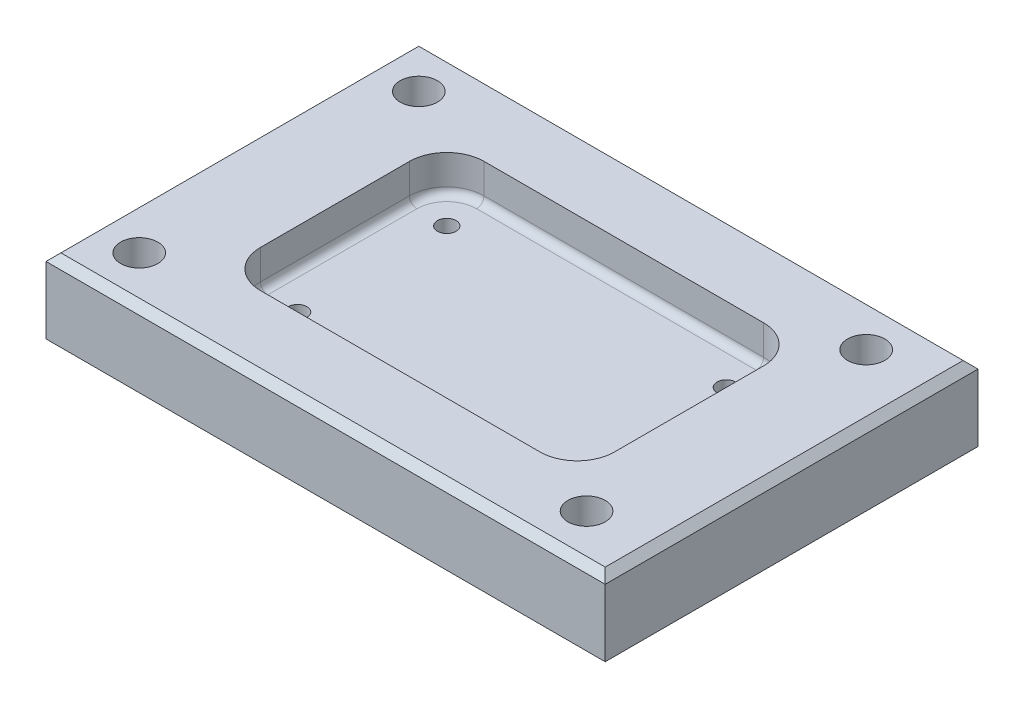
from build123d import *

# Parameters (mm, degrees)
SKETCH1_W                = 150
SKETCH1_H                = 100
BOSS_EXTRUDE1_DEPTH      = 20
POCKET_DEPTH             = 10
FILLET1_R                = 2
SKETCH3_R                = 2.5
DIA_5_HOLE_DEPTH         = 91.691785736
DIA_5X4_HOLE_COUNT       = 2
DIA_5X4_HOLE_PITCH       = 75
DIA_5X4_HOLE_COUNT_DIR2  = 2
DIA_5X4_HOLE_PITCH_DIR2  = 40
SKETCH4_R                = 5
DIA_10_HOLE_DEPTH        = 93.330926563
DIA_10X4_HOLE_COUNT      = 2
DIA_10X4_HOLE_PITCH      = 75
DIA_10X4_HOLE_COUNT_DIR2 = 2
DIA_10X4_HOLE_PITCH_DIR2 = 120
CHAMFER1_SIZE            = 2


with BuildPart() as part:
    # Sketch1 → Boss-Extrude1 (new body)
    with BuildSketch(Plane(origin=(0, 0, 0), x_dir=(1, 0, 0), z_dir=(0, 1, 0))):
        Rectangle(SKETCH1_W, SKETCH1_H)
    extrude(amount=BOSS_EXTRUDE1_DEPTH)

    # Sketch2 → Pocket (cut)
    with BuildSketch(Plane(origin=(0, 20, 0), x_dir=(-1, 0, 0), z_dir=(0, 1, 0))):
        with BuildLine():
            Line((-37.5, 30), (37.5, 30))
            ThreePointArc((37.5, 30), (44.571067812, 27.071067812), (47.5, 20))
            Line((47.5, 20), (47.5, -20))
            ThreePointArc((47.5, -20), (44.571067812, -27.071067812), (37.5, -30))
            Line((37.5, -30), (-37.5, -30))
            ThreePointArc((-37.5, -30), (-44.571067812, -27.071067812), (-47.5, -20))
            Line((-47.5, -20), (-47.5, 20))
            ThreePointArc((-47.5, 20), (-44.571067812, 27.071067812), (-37.5, 30))
        make_face()
    extrude(amount=-POCKET_DEPTH, mode=Mode.SUBTRACT)

    # Fillet1
    fillet1_edges = [part.edges().sort_by_distance(p)[0] for p in [
        (-44.571067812, 10, 27.071067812),
        (-47.5, 10, 0),
        (-44.571067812, 10, -27.071067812),
        (0, 10, -30),
        (44.571067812, 10, -27.071067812),
        (47.5, 10, 0),
        (44.571067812, 10, 27.071067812),
        (0, 10, 30),
    ]]
    fillet(fillet1_edges, radius=FILLET1_R)

    # Sketch3 → Dia 5 Hole (cut, through all)
    with BuildSketch(Plane(origin=(0, 10, 0), x_dir=(-1, 0, 0), z_dir=(0, 1, 0))):
        with Locations(Location((-37.5, 20, 0), (0, 0, 90))):
            Circle(SKETCH3_R)
    dia_5_hole = extrude(amount=-DIA_5_HOLE_DEPTH, mode=Mode.SUBTRACT)

    # Dia 5X4 Hole: Dia 5 Hole 2 × 2
    with Locations(*[(-i * DIA_5X4_HOLE_PITCH, 0, -j * DIA_5X4_HOLE_PITCH_DIR2) for i in range(DIA_5X4_HOLE_COUNT) for j in range(DIA_5X4_HOLE_COUNT_DIR2) if (i, j) != (0, 0)]):
        add(dia_5_hole, mode=Mode.SUBTRACT)

    # Sketch4 → Dia 10 Hole (cut, through all)
    with BuildSketch(Plane(origin=(0, 20, 0), x_dir=(-1, 0, 0), z_dir=(0, 1, 0))):
        with Locations(Location((62.5, 37.5, 0), (0, 0, 90))):
            Circle(SKETCH4_R)
    dia_10_hole = extrude(amount=-DIA_10_HOLE_DEPTH, mode=Mode.SUBTRACT)

    # Dia 10X4 Hole: Dia 10 Hole 2 × 2
    with Locations(*[(j * DIA_10X4_HOLE_PITCH_DIR2, 0, -i * DIA_10X4_HOLE_PITCH) for i in range(DIA_10X4_HOLE_COUNT) for j in range(DIA_10X4_HOLE_COUNT_DIR2) if (i, j) != (0, 0)]):
        add(dia_10_hole, mode=Mode.SUBTRACT)

    # Chamfer1
    chamfer1_edges = [part.edges().sort_by_distance(p)[0] for p in [
        (75, 20, 0),
        (0, 20, -50),
        (-75, 20, 0),
        (0, 20, 50),
    ]]
    chamfer(chamfer1_edges, length=CHAMFER1_SIZE)


solid = part.part
